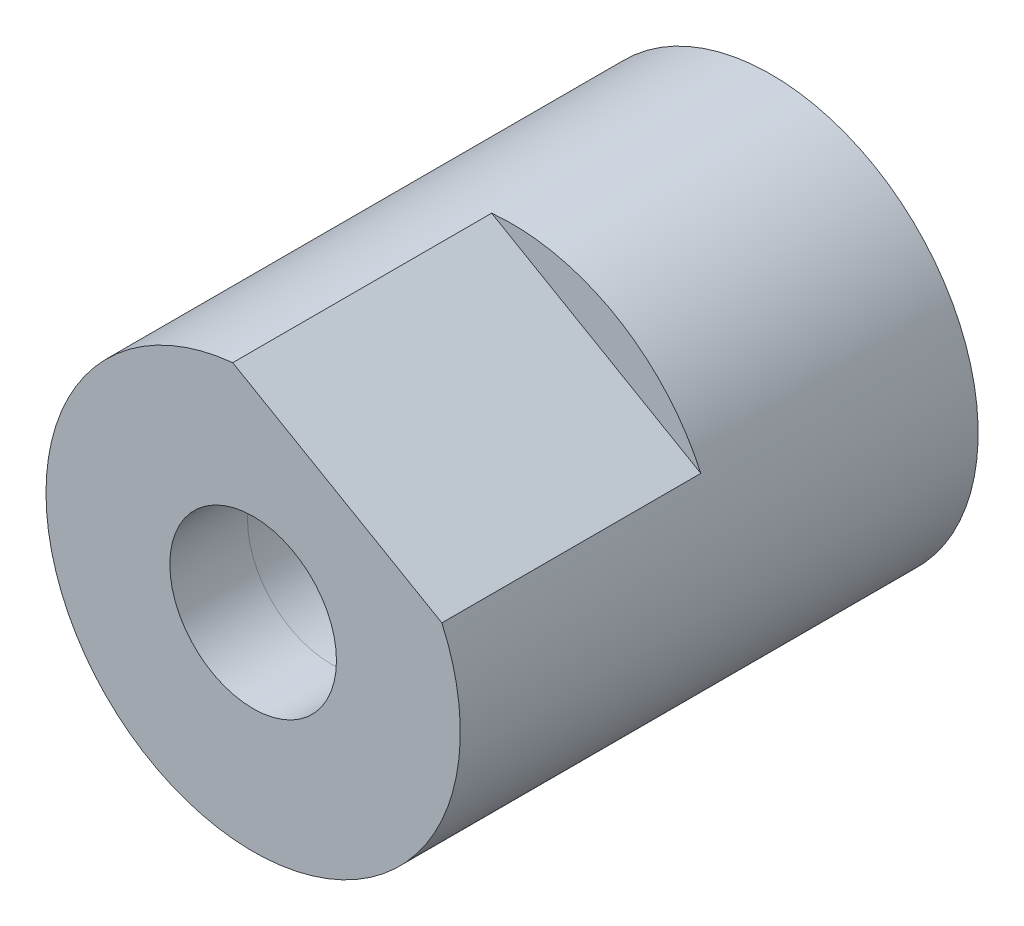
from build123d import *

# Parameters (mm, degrees)
CUT_EXTRUDE1_START = -15.875
CUT_EXTRUDE1_DEPTH = 15.875


with BuildPart() as part:
    # Logo3_bib1 → Revolve1 (revolve)
    with BuildSketch(Plane(origin=(0, 0, 0), x_dir=(-1, 0, 0), z_dir=(0, -1, 0))):
        Polygon((6.2024895, 0), (5.10794, -26.9875), (5.10794, -31.75), (12.7, -31.75), (12.7, 0), align=None)
    revolve(axis=Axis((0, 0, -41.537203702), (0, 0, 1)))

    # Sketch1 → Cut-Extrude1 (cut)
    with BuildSketch(Plane.XY.offset(31.75).offset(CUT_EXTRUDE1_START)):
        with BuildLine():
            Line((-1.252336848, 12.638103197), (11.571086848, 5.234496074))
            ThreePointArc((11.571086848, 5.234496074), (6.35, 10.998522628), (-1.252336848, 12.638103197))
        make_face()
    extrude(amount=CUT_EXTRUDE1_DEPTH, mode=Mode.SUBTRACT)


solid = part.part
